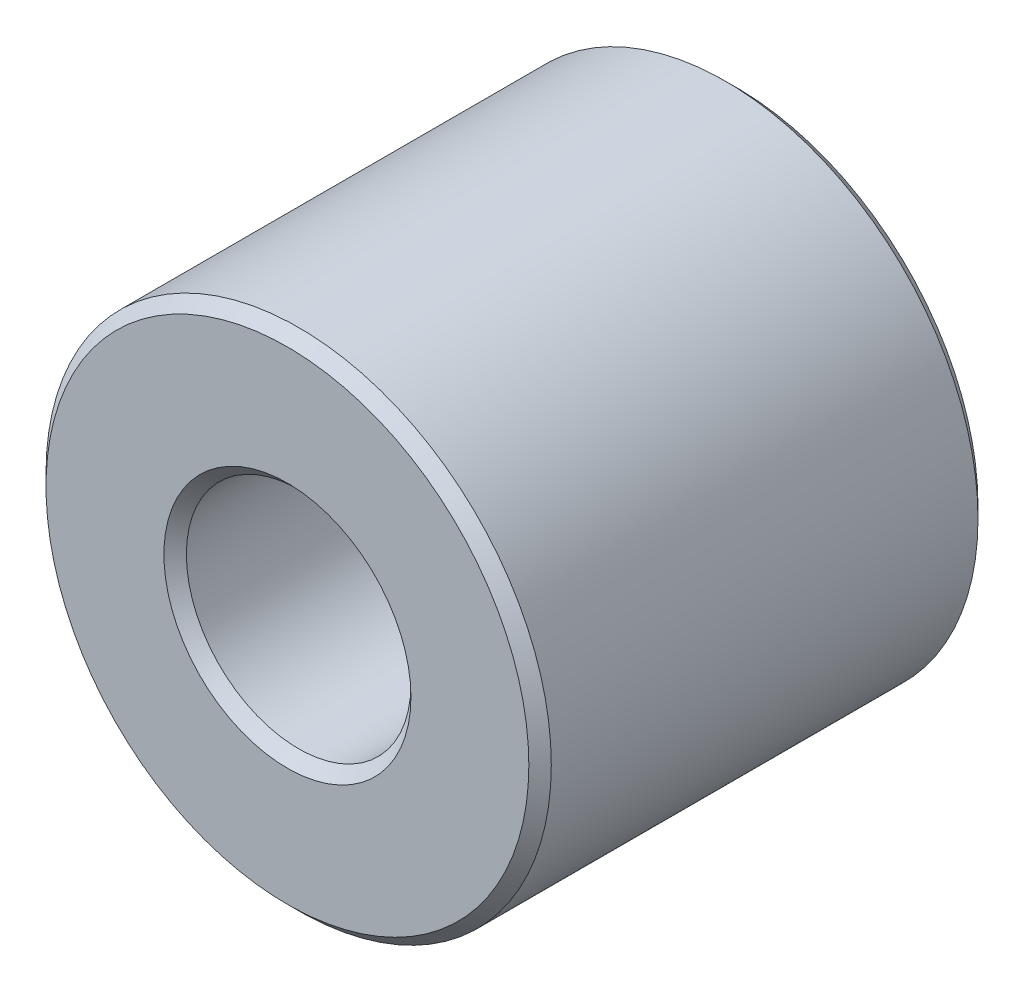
from build123d import *

# Parameters (mm, degrees)
SKETCH1_R           = 22.5
SKETCH1_R_2         = 10
BOSS_EXTRUDE1_DEPTH = 20
CHAMFER1_SIZE       = 1


with BuildPart() as part:
    # Sketch1 → Boss-Extrude1 (new, symmetric)
    with BuildSketch(Plane.XY):
        Circle(SKETCH1_R)
        Circle(SKETCH1_R_2, mode=Mode.SUBTRACT)
    extrude(amount=BOSS_EXTRUDE1_DEPTH, both=True)

    # Chamfer1
    chamfer1_edges = [part.edges().sort_by_distance(p)[0] for p in [
        (-22.5, 0, -20),
        (-22.5, 0, 20),
        (-10, 0, -20),
        (-10, 0, 20),
    ]]
    chamfer(chamfer1_edges, length=CHAMFER1_SIZE)


solid = part.part
